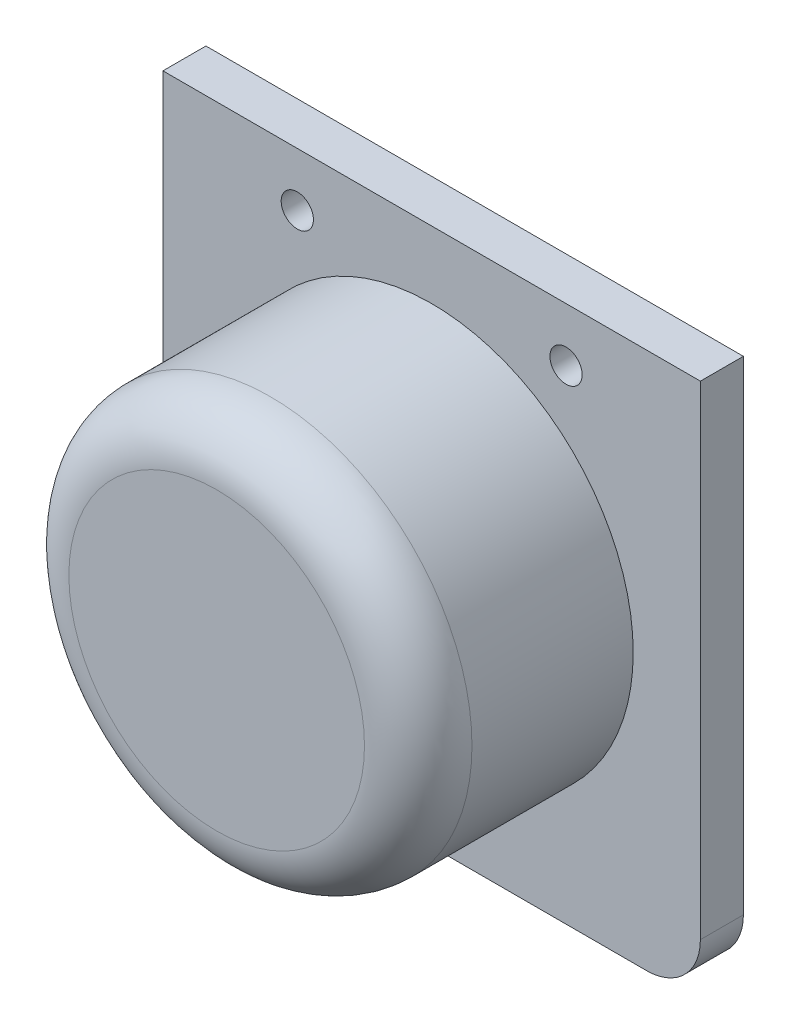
ISO-10303-21;
HEADER;
FILE_DESCRIPTION(('STEP AP214'),'2;1');
FILE_NAME('part.step','',(''),(''),'','','');
FILE_SCHEMA(('AUTOMOTIVE_DESIGN { 1 0 10303 214 1 1 1 1 }'));
ENDSEC;
DATA;
#1=APPLICATION_CONTEXT('core data for automotive mechanical design processes');
#2=APPLICATION_PROTOCOL_DEFINITION('international standard','automotive_design',2000,#1);
#3=PRODUCT_CONTEXT('',#1,'mechanical');
#4=PRODUCT('Part','Part','',(#3));
#5=PRODUCT_RELATED_PRODUCT_CATEGORY('part','',(#4));
#6=PRODUCT_DEFINITION_FORMATION('','',#4);
#7=PRODUCT_DEFINITION_CONTEXT('part definition',#1,'design');
#8=PRODUCT_DEFINITION('design','',#6,#7);
#9=PRODUCT_DEFINITION_SHAPE('','',#8);
#10=(LENGTH_UNIT() NAMED_UNIT(*) SI_UNIT(.MILLI.,.METRE.));
#11=(NAMED_UNIT(*) PLANE_ANGLE_UNIT() SI_UNIT($,.RADIAN.));
#12=(NAMED_UNIT(*) SI_UNIT($,.STERADIAN.) SOLID_ANGLE_UNIT());
#13=UNCERTAINTY_MEASURE_WITH_UNIT(LENGTH_MEASURE(1.E-05),#10,'distance_accuracy_value','');
#14=(GEOMETRIC_REPRESENTATION_CONTEXT(3) GLOBAL_UNCERTAINTY_ASSIGNED_CONTEXT((#13)) GLOBAL_UNIT_ASSIGNED_CONTEXT((#10,
#11,#12)) REPRESENTATION_CONTEXT('',''));
#15=CARTESIAN_POINT('',(0.,0.,0.));
#16=DIRECTION('',(0.,0.,1.));
#17=DIRECTION('',(1.,0.,0.));
#18=AXIS2_PLACEMENT_3D('',#15,#16,#17);
#19=CARTESIAN_POINT('',(50.,50.,8.));
#20=DIRECTION('',(-1.,0.,0.));
#21=DIRECTION('',(0.,-1.,0.));
#22=AXIS2_PLACEMENT_3D('',#19,#20,#21);
#23=PLANE('',#22);
#24=DIRECTION('',(0.,1.,0.));
#25=VECTOR('',#24,1.);
#26=CARTESIAN_POINT('',(50.,50.,8.));
#27=LINE('',#26,#25);
#28=CARTESIAN_POINT('',(50.,-40.,8.));
#29=VERTEX_POINT('',#28);
#30=CARTESIAN_POINT('',(50.,50.,8.));
#31=VERTEX_POINT('',#30);
#32=EDGE_CURVE('E88',#29,#31,#27,.T.);
#33=ORIENTED_EDGE('',*,*,#32,.F.);
#34=DIRECTION('',(0.,0.,-1.));
#35=VECTOR('',#34,1.);
#36=CARTESIAN_POINT('',(50.,-40.,8.));
#37=LINE('',#36,#35);
#38=CARTESIAN_POINT('',(50.,-40.,0.));
#39=VERTEX_POINT('',#38);
#40=EDGE_CURVE('E125',#29,#39,#37,.T.);
#41=ORIENTED_EDGE('',*,*,#40,.T.);
#42=DIRECTION('',(0.,1.,0.));
#43=VECTOR('',#42,1.);
#44=CARTESIAN_POINT('',(50.,50.,0.));
#45=LINE('',#44,#43);
#46=CARTESIAN_POINT('',(50.,50.,0.));
#47=VERTEX_POINT('',#46);
#48=EDGE_CURVE('E109',#39,#47,#45,.T.);
#49=ORIENTED_EDGE('',*,*,#48,.T.);
#50=DIRECTION('',(0.,0.,-1.));
#51=VECTOR('',#50,1.);
#52=CARTESIAN_POINT('',(50.,50.,8.));
#53=LINE('',#52,#51);
#54=EDGE_CURVE('E103',#31,#47,#53,.T.);
#55=ORIENTED_EDGE('',*,*,#54,.F.);
#56=EDGE_LOOP('',(#33,#41,#49,#55));
#57=FACE_BOUND('',#56,.T.);
#58=ADVANCED_FACE('F34',(#57),#23,.F.);
#59=CARTESIAN_POINT('',(-50.,50.,8.));
#60=DIRECTION('',(0.,-1.,0.));
#61=DIRECTION('',(0.,0.,-1.));
#62=AXIS2_PLACEMENT_3D('',#59,#60,#61);
#63=PLANE('',#62);
#64=DIRECTION('',(-1.,0.,0.));
#65=VECTOR('',#64,1.);
#66=CARTESIAN_POINT('',(-50.,50.,0.));
#67=LINE('',#66,#65);
#68=CARTESIAN_POINT('',(-50.,50.,0.));
#69=VERTEX_POINT('',#68);
#70=EDGE_CURVE('E147',#47,#69,#67,.T.);
#71=ORIENTED_EDGE('',*,*,#70,.T.);
#72=DIRECTION('',(0.,0.,-1.));
#73=VECTOR('',#72,1.);
#74=CARTESIAN_POINT('',(-50.,50.,8.));
#75=LINE('',#74,#73);
#76=CARTESIAN_POINT('',(-50.,50.,8.));
#77=VERTEX_POINT('',#76);
#78=EDGE_CURVE('E105',#77,#69,#75,.T.);
#79=ORIENTED_EDGE('',*,*,#78,.F.);
#80=DIRECTION('',(-1.,0.,0.));
#81=VECTOR('',#80,1.);
#82=CARTESIAN_POINT('',(-50.,50.,8.));
#83=LINE('',#82,#81);
#84=EDGE_CURVE('E91',#31,#77,#83,.T.);
#85=ORIENTED_EDGE('',*,*,#84,.F.);
#86=ORIENTED_EDGE('',*,*,#54,.T.);
#87=EDGE_LOOP('',(#71,#79,#85,#86));
#88=FACE_BOUND('',#87,.T.);
#89=ADVANCED_FACE('F102',(#88),#63,.F.);
#90=CARTESIAN_POINT('',(-50.,50.,8.));
#91=DIRECTION('',(1.,0.,0.));
#92=DIRECTION('',(0.,1.,0.));
#93=AXIS2_PLACEMENT_3D('',#90,#91,#92);
#94=PLANE('',#93);
#95=DIRECTION('',(0.,-1.,0.));
#96=VECTOR('',#95,1.);
#97=CARTESIAN_POINT('',(-50.,50.,0.));
#98=LINE('',#97,#96);
#99=CARTESIAN_POINT('',(-50.,-40.,0.));
#100=VERTEX_POINT('',#99);
#101=EDGE_CURVE('E145',#69,#100,#98,.T.);
#102=ORIENTED_EDGE('',*,*,#101,.T.);
#103=DIRECTION('',(0.,0.,-1.));
#104=VECTOR('',#103,1.);
#105=CARTESIAN_POINT('',(-50.,-40.,8.));
#106=LINE('',#105,#104);
#107=CARTESIAN_POINT('',(-50.,-40.,8.));
#108=VERTEX_POINT('',#107);
#109=EDGE_CURVE('E11',#100,#108,#106,.F.);
#110=ORIENTED_EDGE('',*,*,#109,.T.);
#111=DIRECTION('',(0.,-1.,0.));
#112=VECTOR('',#111,1.);
#113=CARTESIAN_POINT('',(-50.,50.,8.));
#114=LINE('',#113,#112);
#115=EDGE_CURVE('E106',#77,#108,#114,.T.);
#116=ORIENTED_EDGE('',*,*,#115,.F.);
#117=ORIENTED_EDGE('',*,*,#78,.T.);
#118=EDGE_LOOP('',(#102,#110,#116,#117));
#119=FACE_BOUND('',#118,.T.);
#120=ADVANCED_FACE('F146',(#119),#94,.F.);
#121=CARTESIAN_POINT('',(-50.,-50.,8.));
#122=DIRECTION('',(0.,1.,0.));
#123=DIRECTION('',(0.,0.,1.));
#124=AXIS2_PLACEMENT_3D('',#121,#122,#123);
#125=PLANE('',#124);
#126=DIRECTION('',(1.,0.,0.));
#127=VECTOR('',#126,1.);
#128=CARTESIAN_POINT('',(-50.,-50.,0.));
#129=LINE('',#128,#127);
#130=CARTESIAN_POINT('',(-40.,-50.,0.));
#131=VERTEX_POINT('',#130);
#132=CARTESIAN_POINT('',(40.,-50.,0.));
#133=VERTEX_POINT('',#132);
#134=EDGE_CURVE('E98',#131,#133,#129,.T.);
#135=ORIENTED_EDGE('',*,*,#134,.T.);
#136=DIRECTION('',(0.,0.,-1.));
#137=VECTOR('',#136,1.);
#138=CARTESIAN_POINT('',(40.,-50.,8.));
#139=LINE('',#138,#137);
#140=CARTESIAN_POINT('',(40.,-50.,8.));
#141=VERTEX_POINT('',#140);
#142=EDGE_CURVE('E55',#133,#141,#139,.F.);
#143=ORIENTED_EDGE('',*,*,#142,.T.);
#144=DIRECTION('',(1.,0.,0.));
#145=VECTOR('',#144,1.);
#146=CARTESIAN_POINT('',(-50.,-50.,8.));
#147=LINE('',#146,#145);
#148=CARTESIAN_POINT('',(-40.,-50.,8.));
#149=VERTEX_POINT('',#148);
#150=EDGE_CURVE('E116',#149,#141,#147,.T.);
#151=ORIENTED_EDGE('',*,*,#150,.F.);
#152=DIRECTION('',(0.,0.,-1.));
#153=VECTOR('',#152,1.);
#154=CARTESIAN_POINT('',(-40.,-50.,8.));
#155=LINE('',#154,#153);
#156=EDGE_CURVE('E131',#149,#131,#155,.T.);
#157=ORIENTED_EDGE('',*,*,#156,.T.);
#158=EDGE_LOOP('',(#135,#143,#151,#157));
#159=FACE_BOUND('',#158,.T.);
#160=ADVANCED_FACE('F139',(#159),#125,.F.);
#161=CARTESIAN_POINT('',(0.,0.,8.));
#162=DIRECTION('',(0.,0.,1.));
#163=DIRECTION('',(1.,0.,0.));
#164=AXIS2_PLACEMENT_3D('',#161,#162,#163);
#165=PLANE('',#164);
#166=CARTESIAN_POINT('',(-40.,-40.,8.));
#167=DIRECTION('',(0.,0.,1.));
#168=DIRECTION('',(1.,0.,0.));
#169=AXIS2_PLACEMENT_3D('',#166,#167,#168);
#170=CIRCLE('',#169,1.5);
#171=CARTESIAN_POINT('',(-38.5,-40.,8.));
#172=VERTEX_POINT('',#171);
#173=EDGE_CURVE('E172',#172,#172,#170,.T.);
#174=ORIENTED_EDGE('',*,*,#173,.F.);
#175=EDGE_LOOP('',(#174));
#176=FACE_BOUND('',#175,.T.);
#177=CARTESIAN_POINT('',(-30.,-40.,8.));
#178=DIRECTION('',(0.,0.,1.));
#179=DIRECTION('',(1.,0.,0.));
#180=AXIS2_PLACEMENT_3D('',#177,#178,#179);
#181=CIRCLE('',#180,1.5);
#182=CARTESIAN_POINT('',(-28.5,-40.,8.));
#183=VERTEX_POINT('',#182);
#184=EDGE_CURVE('E169',#183,#183,#181,.T.);
#185=ORIENTED_EDGE('',*,*,#184,.F.);
#186=EDGE_LOOP('',(#185));
#187=FACE_BOUND('',#186,.T.);
#188=CARTESIAN_POINT('',(25.,40.,8.));
#189=DIRECTION('',(0.,0.,1.));
#190=DIRECTION('',(1.,0.,0.));
#191=AXIS2_PLACEMENT_3D('',#188,#189,#190);
#192=CIRCLE('',#191,3.);
#193=CARTESIAN_POINT('',(28.,40.,8.));
#194=VERTEX_POINT('',#193);
#195=EDGE_CURVE('E161',#194,#194,#192,.F.);
#196=ORIENTED_EDGE('',*,*,#195,.T.);
#197=EDGE_LOOP('',(#196));
#198=FACE_BOUND('',#197,.T.);
#199=CARTESIAN_POINT('',(-25.,40.,8.));
#200=DIRECTION('',(0.,0.,1.));
#201=DIRECTION('',(1.,0.,0.));
#202=AXIS2_PLACEMENT_3D('',#199,#200,#201);
#203=CIRCLE('',#202,3.);
#204=CARTESIAN_POINT('',(-22.,40.,8.));
#205=VERTEX_POINT('',#204);
#206=EDGE_CURVE('E154',#205,#205,#203,.F.);
#207=ORIENTED_EDGE('',*,*,#206,.T.);
#208=EDGE_LOOP('',(#207));
#209=FACE_BOUND('',#208,.T.);
#210=CARTESIAN_POINT('',(0.,0.,8.));
#211=DIRECTION('',(0.,0.,1.));
#212=DIRECTION('',(1.,0.,0.));
#213=AXIS2_PLACEMENT_3D('',#210,#211,#212);
#214=CIRCLE('',#213,37.5);
#215=CARTESIAN_POINT('',(37.5,0.,8.));
#216=VERTEX_POINT('',#215);
#217=EDGE_CURVE('E111',#216,#216,#214,.T.);
#218=ORIENTED_EDGE('',*,*,#217,.F.);
#219=EDGE_LOOP('',(#218));
#220=FACE_BOUND('',#219,.T.);
#221=ORIENTED_EDGE('',*,*,#150,.T.);
#222=CARTESIAN_POINT('',(40.,-40.,8.));
#223=DIRECTION('',(0.,0.,1.));
#224=DIRECTION('',(1.,0.,0.));
#225=AXIS2_PLACEMENT_3D('',#222,#223,#224);
#226=CIRCLE('',#225,10.);
#227=EDGE_CURVE('E42',#141,#29,#226,.T.);
#228=ORIENTED_EDGE('',*,*,#227,.T.);
#229=ORIENTED_EDGE('',*,*,#32,.T.);
#230=ORIENTED_EDGE('',*,*,#84,.T.);
#231=ORIENTED_EDGE('',*,*,#115,.T.);
#232=CARTESIAN_POINT('',(-40.,-40.,8.));
#233=DIRECTION('',(0.,0.,1.));
#234=DIRECTION('',(1.,0.,0.));
#235=AXIS2_PLACEMENT_3D('',#232,#233,#234);
#236=CIRCLE('',#235,10.);
#237=EDGE_CURVE('E135',#108,#149,#236,.T.);
#238=ORIENTED_EDGE('',*,*,#237,.T.);
#239=EDGE_LOOP('',(#221,#228,#229,#230,#231,#238));
#240=FACE_BOUND('',#239,.T.);
#241=ADVANCED_FACE('F90',(#176,#187,#198,#209,#220,#240),#165,.T.);
#242=CARTESIAN_POINT('',(0.,0.,0.));
#243=DIRECTION('',(0.,0.,1.));
#244=DIRECTION('',(1.,0.,0.));
#245=AXIS2_PLACEMENT_3D('',#242,#243,#244);
#246=PLANE('',#245);
#247=CARTESIAN_POINT('',(25.,40.,0.));
#248=DIRECTION('',(0.,0.,-1.));
#249=DIRECTION('',(-1.,0.,0.));
#250=AXIS2_PLACEMENT_3D('',#247,#248,#249);
#251=CIRCLE('',#250,3.);
#252=CARTESIAN_POINT('',(22.,40.,0.));
#253=VERTEX_POINT('',#252);
#254=EDGE_CURVE('E151',#253,#253,#251,.T.);
#255=ORIENTED_EDGE('',*,*,#254,.F.);
#256=EDGE_LOOP('',(#255));
#257=FACE_BOUND('',#256,.T.);
#258=CARTESIAN_POINT('',(-25.,40.,0.));
#259=DIRECTION('',(0.,0.,-1.));
#260=DIRECTION('',(-1.,0.,0.));
#261=AXIS2_PLACEMENT_3D('',#258,#259,#260);
#262=CIRCLE('',#261,3.);
#263=CARTESIAN_POINT('',(-28.,40.,0.));
#264=VERTEX_POINT('',#263);
#265=EDGE_CURVE('E157',#264,#264,#262,.T.);
#266=ORIENTED_EDGE('',*,*,#265,.F.);
#267=EDGE_LOOP('',(#266));
#268=FACE_BOUND('',#267,.T.);
#269=ORIENTED_EDGE('',*,*,#48,.F.);
#270=CARTESIAN_POINT('',(40.,-40.,0.));
#271=DIRECTION('',(0.,0.,1.));
#272=DIRECTION('',(1.,0.,0.));
#273=AXIS2_PLACEMENT_3D('',#270,#271,#272);
#274=CIRCLE('',#273,10.);
#275=EDGE_CURVE('E129',#39,#133,#274,.F.);
#276=ORIENTED_EDGE('',*,*,#275,.T.);
#277=ORIENTED_EDGE('',*,*,#134,.F.);
#278=CARTESIAN_POINT('',(-40.,-40.,0.));
#279=DIRECTION('',(0.,0.,1.));
#280=DIRECTION('',(1.,0.,0.));
#281=AXIS2_PLACEMENT_3D('',#278,#279,#280);
#282=CIRCLE('',#281,10.);
#283=EDGE_CURVE('E127',#131,#100,#282,.F.);
#284=ORIENTED_EDGE('',*,*,#283,.T.);
#285=ORIENTED_EDGE('',*,*,#101,.F.);
#286=ORIENTED_EDGE('',*,*,#70,.F.);
#287=EDGE_LOOP('',(#269,#276,#277,#284,#285,#286));
#288=FACE_BOUND('',#287,.T.);
#289=ADVANCED_FACE('F144',(#257,#268,#288),#246,.F.);
#290=CARTESIAN_POINT('',(0.,0.,48.));
#291=DIRECTION('',(0.,0.,-1.));
#292=DIRECTION('',(-1.,0.,0.));
#293=AXIS2_PLACEMENT_3D('',#290,#291,#292);
#294=CYLINDRICAL_SURFACE('',#293,37.5);
#295=CARTESIAN_POINT('',(0.,0.,38.));
#296=DIRECTION('',(0.,0.,1.));
#297=DIRECTION('',(1.,0.,0.));
#298=AXIS2_PLACEMENT_3D('',#295,#296,#297);
#299=CIRCLE('',#298,37.5);
#300=CARTESIAN_POINT('',(37.5,0.,38.));
#301=VERTEX_POINT('',#300);
#302=EDGE_CURVE('E122',#301,#301,#299,.F.);
#303=ORIENTED_EDGE('',*,*,#302,.T.);
#304=EDGE_LOOP('',(#303));
#305=FACE_BOUND('',#304,.T.);
#306=ORIENTED_EDGE('',*,*,#217,.T.);
#307=EDGE_LOOP('',(#306));
#308=FACE_BOUND('',#307,.T.);
#309=ADVANCED_FACE('F198',(#305,#308),#294,.T.);
#310=CARTESIAN_POINT('',(0.,0.,48.));
#311=DIRECTION('',(0.,0.,1.));
#312=DIRECTION('',(1.,0.,0.));
#313=AXIS2_PLACEMENT_3D('',#310,#311,#312);
#314=PLANE('',#313);
#315=CARTESIAN_POINT('',(0.,0.,48.));
#316=DIRECTION('',(0.,0.,1.));
#317=DIRECTION('',(1.,0.,0.));
#318=AXIS2_PLACEMENT_3D('',#315,#316,#317);
#319=CIRCLE('',#318,27.5);
#320=CARTESIAN_POINT('',(27.5,0.,48.));
#321=VERTEX_POINT('',#320);
#322=EDGE_CURVE('E114',#321,#321,#319,.T.);
#323=ORIENTED_EDGE('',*,*,#322,.T.);
#324=EDGE_LOOP('',(#323));
#325=FACE_BOUND('',#324,.T.);
#326=ADVANCED_FACE('F200',(#325),#314,.T.);
#327=CARTESIAN_POINT('',(-25.,40.,48.001));
#328=DIRECTION('',(0.,0.,-1.));
#329=DIRECTION('',(-1.,0.,0.));
#330=AXIS2_PLACEMENT_3D('',#327,#328,#329);
#331=CYLINDRICAL_SURFACE('',#330,3.);
#332=ORIENTED_EDGE('',*,*,#206,.F.);
#333=EDGE_LOOP('',(#332));
#334=FACE_BOUND('',#333,.T.);
#335=ORIENTED_EDGE('',*,*,#265,.T.);
#336=EDGE_LOOP('',(#335));
#337=FACE_BOUND('',#336,.T.);
#338=ADVANCED_FACE('F207',(#334,#337),#331,.F.);
#339=CARTESIAN_POINT('',(25.,40.,48.001));
#340=DIRECTION('',(0.,0.,-1.));
#341=DIRECTION('',(-1.,0.,0.));
#342=AXIS2_PLACEMENT_3D('',#339,#340,#341);
#343=CYLINDRICAL_SURFACE('',#342,3.);
#344=ORIENTED_EDGE('',*,*,#195,.F.);
#345=EDGE_LOOP('',(#344));
#346=FACE_BOUND('',#345,.T.);
#347=ORIENTED_EDGE('',*,*,#254,.T.);
#348=EDGE_LOOP('',(#347));
#349=FACE_BOUND('',#348,.T.);
#350=ADVANCED_FACE('F223',(#346,#349),#343,.F.);
#351=CARTESIAN_POINT('',(0.,0.,38.));
#352=DIRECTION('',(0.,0.,1.));
#353=DIRECTION('',(1.,0.,0.));
#354=AXIS2_PLACEMENT_3D('',#351,#352,#353);
#355=TOROIDAL_SURFACE('',#354,27.5,10.);
#356=ORIENTED_EDGE('',*,*,#302,.F.);
#357=EDGE_LOOP('',(#356));
#358=FACE_BOUND('',#357,.T.);
#359=ORIENTED_EDGE('',*,*,#322,.F.);
#360=EDGE_LOOP('',(#359));
#361=FACE_BOUND('',#360,.T.);
#362=ADVANCED_FACE('F220',(#358,#361),#355,.T.);
#363=CARTESIAN_POINT('',(40.,-40.,8.));
#364=DIRECTION('',(0.,0.,-1.));
#365=DIRECTION('',(-1.,0.,0.));
#366=AXIS2_PLACEMENT_3D('',#363,#364,#365);
#367=CYLINDRICAL_SURFACE('',#366,10.);
#368=ORIENTED_EDGE('',*,*,#227,.F.);
#369=ORIENTED_EDGE('',*,*,#142,.F.);
#370=ORIENTED_EDGE('',*,*,#275,.F.);
#371=ORIENTED_EDGE('',*,*,#40,.F.);
#372=EDGE_LOOP('',(#368,#369,#370,#371));
#373=FACE_BOUND('',#372,.T.);
#374=ADVANCED_FACE('F222',(#373),#367,.T.);
#375=CARTESIAN_POINT('',(-40.,-40.,8.));
#376=DIRECTION('',(0.,0.,-1.));
#377=DIRECTION('',(-1.,0.,0.));
#378=AXIS2_PLACEMENT_3D('',#375,#376,#377);
#379=CYLINDRICAL_SURFACE('',#378,10.);
#380=ORIENTED_EDGE('',*,*,#237,.F.);
#381=ORIENTED_EDGE('',*,*,#109,.F.);
#382=ORIENTED_EDGE('',*,*,#283,.F.);
#383=ORIENTED_EDGE('',*,*,#156,.F.);
#384=EDGE_LOOP('',(#380,#381,#382,#383));
#385=FACE_BOUND('',#384,.T.);
#386=ADVANCED_FACE('F36',(#385),#379,.T.);
#387=CARTESIAN_POINT('',(-30.,-40.,6.));
#388=DIRECTION('',(0.,0.,1.));
#389=DIRECTION('',(1.,0.,0.));
#390=AXIS2_PLACEMENT_3D('',#387,#388,#389);
#391=CYLINDRICAL_SURFACE('',#390,1.5);
#392=CARTESIAN_POINT('',(-30.,-40.,6.));
#393=DIRECTION('',(0.,0.,1.));
#394=DIRECTION('',(1.,0.,0.));
#395=AXIS2_PLACEMENT_3D('',#392,#393,#394);
#396=CIRCLE('',#395,1.5);
#397=CARTESIAN_POINT('',(-28.5,-40.,6.));
#398=VERTEX_POINT('',#397);
#399=EDGE_CURVE('E166',#398,#398,#396,.T.);
#400=ORIENTED_EDGE('',*,*,#399,.F.);
#401=EDGE_LOOP('',(#400));
#402=FACE_BOUND('',#401,.T.);
#403=ORIENTED_EDGE('',*,*,#184,.T.);
#404=EDGE_LOOP('',(#403));
#405=FACE_BOUND('',#404,.T.);
#406=ADVANCED_FACE('F230',(#402,#405),#391,.F.);
#407=CARTESIAN_POINT('',(-30.,-40.,6.));
#408=DIRECTION('',(0.,0.,1.));
#409=DIRECTION('',(1.,0.,0.));
#410=AXIS2_PLACEMENT_3D('',#407,#408,#409);
#411=PLANE('',#410);
#412=ORIENTED_EDGE('',*,*,#399,.T.);
#413=EDGE_LOOP('',(#412));
#414=FACE_BOUND('',#413,.T.);
#415=ADVANCED_FACE('F183',(#414),#411,.T.);
#416=CARTESIAN_POINT('',(-40.,-40.,6.));
#417=DIRECTION('',(0.,0.,1.));
#418=DIRECTION('',(1.,0.,0.));
#419=AXIS2_PLACEMENT_3D('',#416,#417,#418);
#420=CYLINDRICAL_SURFACE('',#419,1.5);
#421=CARTESIAN_POINT('',(-40.,-40.,6.));
#422=DIRECTION('',(0.,0.,1.));
#423=DIRECTION('',(1.,0.,0.));
#424=AXIS2_PLACEMENT_3D('',#421,#422,#423);
#425=CIRCLE('',#424,1.5);
#426=CARTESIAN_POINT('',(-38.5,-40.,6.));
#427=VERTEX_POINT('',#426);
#428=EDGE_CURVE('E158',#427,#427,#425,.T.);
#429=ORIENTED_EDGE('',*,*,#428,.F.);
#430=EDGE_LOOP('',(#429));
#431=FACE_BOUND('',#430,.T.);
#432=ORIENTED_EDGE('',*,*,#173,.T.);
#433=EDGE_LOOP('',(#432));
#434=FACE_BOUND('',#433,.T.);
#435=ADVANCED_FACE('F180',(#431,#434),#420,.F.);
#436=CARTESIAN_POINT('',(-40.,-40.,6.));
#437=DIRECTION('',(0.,0.,1.));
#438=DIRECTION('',(1.,0.,0.));
#439=AXIS2_PLACEMENT_3D('',#436,#437,#438);
#440=PLANE('',#439);
#441=ORIENTED_EDGE('',*,*,#428,.T.);
#442=EDGE_LOOP('',(#441));
#443=FACE_BOUND('',#442,.T.);
#444=ADVANCED_FACE('F178',(#443),#440,.T.);
#445=CLOSED_SHELL('',(#58,#89,#120,#160,#241,#289,#309,#326,#338,#350,#362,#374,#386,#406,#415,
#435,#444));
#446=MANIFOLD_SOLID_BREP('B2',#445);
#447=ADVANCED_BREP_SHAPE_REPRESENTATION('',(#18,#446),#14);
#448=SHAPE_DEFINITION_REPRESENTATION(#9,#447);
ENDSEC;
END-ISO-10303-21;
